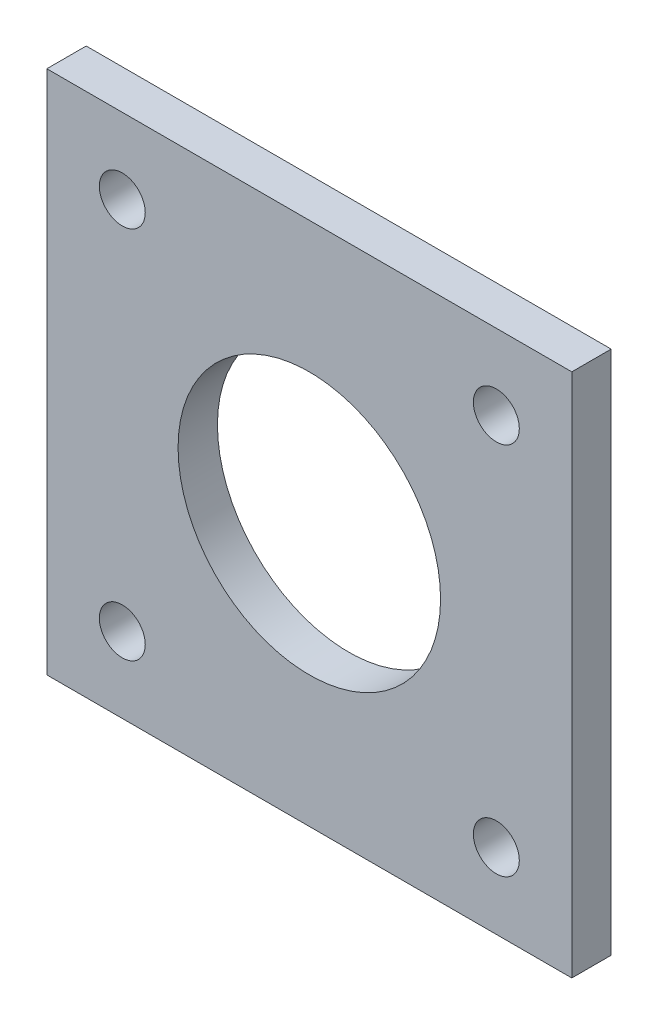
ISO-10303-21;
HEADER;
FILE_DESCRIPTION(('STEP AP214'),'2;1');
FILE_NAME('part.step','',(''),(''),'','','');
FILE_SCHEMA(('AUTOMOTIVE_DESIGN { 1 0 10303 214 1 1 1 1 }'));
ENDSEC;
DATA;
#1=APPLICATION_CONTEXT('core data for automotive mechanical design processes');
#2=APPLICATION_PROTOCOL_DEFINITION('international standard','automotive_design',2000,#1);
#3=PRODUCT_CONTEXT('',#1,'mechanical');
#4=PRODUCT('Part','Part','',(#3));
#5=PRODUCT_RELATED_PRODUCT_CATEGORY('part','',(#4));
#6=PRODUCT_DEFINITION_FORMATION('','',#4);
#7=PRODUCT_DEFINITION_CONTEXT('part definition',#1,'design');
#8=PRODUCT_DEFINITION('design','',#6,#7);
#9=PRODUCT_DEFINITION_SHAPE('','',#8);
#10=(LENGTH_UNIT() NAMED_UNIT(*) SI_UNIT(.MILLI.,.METRE.));
#11=(NAMED_UNIT(*) PLANE_ANGLE_UNIT() SI_UNIT($,.RADIAN.));
#12=(NAMED_UNIT(*) SI_UNIT($,.STERADIAN.) SOLID_ANGLE_UNIT());
#13=UNCERTAINTY_MEASURE_WITH_UNIT(LENGTH_MEASURE(1.E-05),#10,'distance_accuracy_value','');
#14=(GEOMETRIC_REPRESENTATION_CONTEXT(3) GLOBAL_UNCERTAINTY_ASSIGNED_CONTEXT((#13)) GLOBAL_UNIT_ASSIGNED_CONTEXT((#10,
#11,#12)) REPRESENTATION_CONTEXT('',''));
#15=CARTESIAN_POINT('',(0.,0.,0.));
#16=DIRECTION('',(0.,0.,1.));
#17=DIRECTION('',(1.,0.,0.));
#18=AXIS2_PLACEMENT_3D('',#15,#16,#17);
#19=CARTESIAN_POINT('',(20.,20.,3.));
#20=DIRECTION('',(-1.,0.,0.));
#21=DIRECTION('',(0.,-1.,0.));
#22=AXIS2_PLACEMENT_3D('',#19,#20,#21);
#23=PLANE('',#22);
#24=DIRECTION('',(0.,1.,0.));
#25=VECTOR('',#24,1.);
#26=CARTESIAN_POINT('',(20.,20.,0.));
#27=LINE('',#26,#25);
#28=CARTESIAN_POINT('',(20.,-20.,0.));
#29=VERTEX_POINT('',#28);
#30=CARTESIAN_POINT('',(20.,20.,0.));
#31=VERTEX_POINT('',#30);
#32=EDGE_CURVE('E98',#29,#31,#27,.T.);
#33=ORIENTED_EDGE('',*,*,#32,.T.);
#34=DIRECTION('',(0.,0.,-1.));
#35=VECTOR('',#34,1.);
#36=CARTESIAN_POINT('',(20.,20.,3.));
#37=LINE('',#36,#35);
#38=CARTESIAN_POINT('',(20.,20.,3.));
#39=VERTEX_POINT('',#38);
#40=EDGE_CURVE('E11',#39,#31,#37,.T.);
#41=ORIENTED_EDGE('',*,*,#40,.F.);
#42=DIRECTION('',(0.,1.,0.));
#43=VECTOR('',#42,1.);
#44=CARTESIAN_POINT('',(20.,20.,3.));
#45=LINE('',#44,#43);
#46=CARTESIAN_POINT('',(20.,-20.,3.));
#47=VERTEX_POINT('',#46);
#48=EDGE_CURVE('E86',#47,#39,#45,.T.);
#49=ORIENTED_EDGE('',*,*,#48,.F.);
#50=DIRECTION('',(0.,0.,-1.));
#51=VECTOR('',#50,1.);
#52=CARTESIAN_POINT('',(20.,-20.,3.));
#53=LINE('',#52,#51);
#54=EDGE_CURVE('E94',#47,#29,#53,.T.);
#55=ORIENTED_EDGE('',*,*,#54,.T.);
#56=EDGE_LOOP('',(#33,#41,#49,#55));
#57=FACE_BOUND('',#56,.T.);
#58=ADVANCED_FACE('F35',(#57),#23,.F.);
#59=CARTESIAN_POINT('',(-20.,20.,3.));
#60=DIRECTION('',(0.,-1.,0.));
#61=DIRECTION('',(0.,0.,-1.));
#62=AXIS2_PLACEMENT_3D('',#59,#60,#61);
#63=PLANE('',#62);
#64=DIRECTION('',(-1.,0.,0.));
#65=VECTOR('',#64,1.);
#66=CARTESIAN_POINT('',(-20.,20.,0.));
#67=LINE('',#66,#65);
#68=CARTESIAN_POINT('',(-20.,20.,0.));
#69=VERTEX_POINT('',#68);
#70=EDGE_CURVE('E90',#31,#69,#67,.T.);
#71=ORIENTED_EDGE('',*,*,#70,.T.);
#72=DIRECTION('',(0.,0.,-1.));
#73=VECTOR('',#72,1.);
#74=CARTESIAN_POINT('',(-20.,20.,3.));
#75=LINE('',#74,#73);
#76=CARTESIAN_POINT('',(-20.,20.,3.));
#77=VERTEX_POINT('',#76);
#78=EDGE_CURVE('E43',#77,#69,#75,.T.);
#79=ORIENTED_EDGE('',*,*,#78,.F.);
#80=DIRECTION('',(-1.,0.,0.));
#81=VECTOR('',#80,1.);
#82=CARTESIAN_POINT('',(-20.,20.,3.));
#83=LINE('',#82,#81);
#84=EDGE_CURVE('E81',#39,#77,#83,.T.);
#85=ORIENTED_EDGE('',*,*,#84,.F.);
#86=ORIENTED_EDGE('',*,*,#40,.T.);
#87=EDGE_LOOP('',(#71,#79,#85,#86));
#88=FACE_BOUND('',#87,.T.);
#89=ADVANCED_FACE('F89',(#88),#63,.F.);
#90=CARTESIAN_POINT('',(-20.,20.,3.));
#91=DIRECTION('',(1.,0.,0.));
#92=DIRECTION('',(0.,0.,-1.));
#93=AXIS2_PLACEMENT_3D('',#90,#91,#92);
#94=PLANE('',#93);
#95=DIRECTION('',(0.,-1.,0.));
#96=VECTOR('',#95,1.);
#97=CARTESIAN_POINT('',(-20.,20.,0.));
#98=LINE('',#97,#96);
#99=CARTESIAN_POINT('',(-20.,-20.,0.));
#100=VERTEX_POINT('',#99);
#101=EDGE_CURVE('E68',#69,#100,#98,.T.);
#102=ORIENTED_EDGE('',*,*,#101,.T.);
#103=DIRECTION('',(0.,0.,-1.));
#104=VECTOR('',#103,1.);
#105=CARTESIAN_POINT('',(-20.,-20.,3.));
#106=LINE('',#105,#104);
#107=CARTESIAN_POINT('',(-20.,-20.,3.));
#108=VERTEX_POINT('',#107);
#109=EDGE_CURVE('E91',#108,#100,#106,.T.);
#110=ORIENTED_EDGE('',*,*,#109,.F.);
#111=DIRECTION('',(0.,-1.,0.));
#112=VECTOR('',#111,1.);
#113=CARTESIAN_POINT('',(-20.,20.,3.));
#114=LINE('',#113,#112);
#115=EDGE_CURVE('E84',#77,#108,#114,.T.);
#116=ORIENTED_EDGE('',*,*,#115,.F.);
#117=ORIENTED_EDGE('',*,*,#78,.T.);
#118=EDGE_LOOP('',(#102,#110,#116,#117));
#119=FACE_BOUND('',#118,.T.);
#120=ADVANCED_FACE('F92',(#119),#94,.F.);
#121=CARTESIAN_POINT('',(-20.,-20.,3.));
#122=DIRECTION('',(0.,1.,0.));
#123=DIRECTION('',(0.,0.,1.));
#124=AXIS2_PLACEMENT_3D('',#121,#122,#123);
#125=PLANE('',#124);
#126=DIRECTION('',(1.,0.,0.));
#127=VECTOR('',#126,1.);
#128=CARTESIAN_POINT('',(-20.,-20.,0.));
#129=LINE('',#128,#127);
#130=EDGE_CURVE('E74',#100,#29,#129,.T.);
#131=ORIENTED_EDGE('',*,*,#130,.T.);
#132=ORIENTED_EDGE('',*,*,#54,.F.);
#133=DIRECTION('',(1.,0.,0.));
#134=VECTOR('',#133,1.);
#135=CARTESIAN_POINT('',(-20.,-20.,3.));
#136=LINE('',#135,#134);
#137=EDGE_CURVE('E51',#108,#47,#136,.T.);
#138=ORIENTED_EDGE('',*,*,#137,.F.);
#139=ORIENTED_EDGE('',*,*,#109,.T.);
#140=EDGE_LOOP('',(#131,#132,#138,#139));
#141=FACE_BOUND('',#140,.T.);
#142=ADVANCED_FACE('F106',(#141),#125,.F.);
#143=CARTESIAN_POINT('',(0.,0.,3.));
#144=DIRECTION('',(0.,0.,1.));
#145=DIRECTION('',(1.,0.,0.));
#146=AXIS2_PLACEMENT_3D('',#143,#144,#145);
#147=PLANE('',#146);
#148=CARTESIAN_POINT('',(0.,0.,3.));
#149=DIRECTION('',(0.,0.,1.));
#150=DIRECTION('',(1.,0.,0.));
#151=AXIS2_PLACEMENT_3D('',#148,#149,#150);
#152=CIRCLE('',#151,10.);
#153=CARTESIAN_POINT('',(10.,0.,3.));
#154=VERTEX_POINT('',#153);
#155=EDGE_CURVE('E136',#154,#154,#152,.T.);
#156=ORIENTED_EDGE('',*,*,#155,.F.);
#157=EDGE_LOOP('',(#156));
#158=FACE_BOUND('',#157,.T.);
#159=CARTESIAN_POINT('',(-14.25,14.25,3.));
#160=DIRECTION('',(0.,0.,1.));
#161=DIRECTION('',(1.,0.,0.));
#162=AXIS2_PLACEMENT_3D('',#159,#160,#161);
#163=CIRCLE('',#162,1.74999999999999);
#164=CARTESIAN_POINT('',(-12.5,14.25,3.));
#165=VERTEX_POINT('',#164);
#166=EDGE_CURVE('E132',#165,#165,#163,.T.);
#167=ORIENTED_EDGE('',*,*,#166,.F.);
#168=EDGE_LOOP('',(#167));
#169=FACE_BOUND('',#168,.T.);
#170=CARTESIAN_POINT('',(14.25,14.25,3.));
#171=DIRECTION('',(0.,0.,1.));
#172=DIRECTION('',(1.,0.,0.));
#173=AXIS2_PLACEMENT_3D('',#170,#171,#172);
#174=CIRCLE('',#173,1.74999999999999);
#175=CARTESIAN_POINT('',(16.,14.25,3.));
#176=VERTEX_POINT('',#175);
#177=EDGE_CURVE('E126',#176,#176,#174,.T.);
#178=ORIENTED_EDGE('',*,*,#177,.F.);
#179=EDGE_LOOP('',(#178));
#180=FACE_BOUND('',#179,.T.);
#181=CARTESIAN_POINT('',(14.25,-14.25,3.));
#182=DIRECTION('',(0.,0.,1.));
#183=DIRECTION('',(1.,0.,0.));
#184=AXIS2_PLACEMENT_3D('',#181,#182,#183);
#185=CIRCLE('',#184,1.74999999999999);
#186=CARTESIAN_POINT('',(16.,-14.25,3.));
#187=VERTEX_POINT('',#186);
#188=EDGE_CURVE('E120',#187,#187,#185,.T.);
#189=ORIENTED_EDGE('',*,*,#188,.F.);
#190=EDGE_LOOP('',(#189));
#191=FACE_BOUND('',#190,.T.);
#192=CARTESIAN_POINT('',(-14.25,-14.25,3.));
#193=DIRECTION('',(0.,0.,1.));
#194=DIRECTION('',(1.,0.,0.));
#195=AXIS2_PLACEMENT_3D('',#192,#193,#194);
#196=CIRCLE('',#195,1.74999999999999);
#197=CARTESIAN_POINT('',(-12.5,-14.25,3.));
#198=VERTEX_POINT('',#197);
#199=EDGE_CURVE('E114',#198,#198,#196,.T.);
#200=ORIENTED_EDGE('',*,*,#199,.F.);
#201=EDGE_LOOP('',(#200));
#202=FACE_BOUND('',#201,.T.);
#203=ORIENTED_EDGE('',*,*,#48,.T.);
#204=ORIENTED_EDGE('',*,*,#84,.T.);
#205=ORIENTED_EDGE('',*,*,#115,.T.);
#206=ORIENTED_EDGE('',*,*,#137,.T.);
#207=EDGE_LOOP('',(#203,#204,#205,#206));
#208=FACE_BOUND('',#207,.T.);
#209=ADVANCED_FACE('F82',(#158,#169,#180,#191,#202,#208),#147,.T.);
#210=CARTESIAN_POINT('',(0.,0.,0.));
#211=DIRECTION('',(0.,0.,1.));
#212=DIRECTION('',(1.,0.,0.));
#213=AXIS2_PLACEMENT_3D('',#210,#211,#212);
#214=PLANE('',#213);
#215=CARTESIAN_POINT('',(0.,0.,0.));
#216=DIRECTION('',(0.,0.,1.));
#217=DIRECTION('',(1.,0.,0.));
#218=AXIS2_PLACEMENT_3D('',#215,#216,#217);
#219=CIRCLE('',#218,10.);
#220=CARTESIAN_POINT('',(10.,0.,0.));
#221=VERTEX_POINT('',#220);
#222=EDGE_CURVE('E135',#221,#221,#219,.T.);
#223=ORIENTED_EDGE('',*,*,#222,.T.);
#224=EDGE_LOOP('',(#223));
#225=FACE_BOUND('',#224,.T.);
#226=CARTESIAN_POINT('',(-14.25,14.25,0.));
#227=DIRECTION('',(0.,0.,1.));
#228=DIRECTION('',(1.,0.,0.));
#229=AXIS2_PLACEMENT_3D('',#226,#227,#228);
#230=CIRCLE('',#229,1.74999999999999);
#231=CARTESIAN_POINT('',(-12.5,14.25,0.));
#232=VERTEX_POINT('',#231);
#233=EDGE_CURVE('E129',#232,#232,#230,.T.);
#234=ORIENTED_EDGE('',*,*,#233,.T.);
#235=EDGE_LOOP('',(#234));
#236=FACE_BOUND('',#235,.T.);
#237=CARTESIAN_POINT('',(14.25,14.25,0.));
#238=DIRECTION('',(0.,0.,1.));
#239=DIRECTION('',(1.,0.,0.));
#240=AXIS2_PLACEMENT_3D('',#237,#238,#239);
#241=CIRCLE('',#240,1.74999999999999);
#242=CARTESIAN_POINT('',(16.,14.25,0.));
#243=VERTEX_POINT('',#242);
#244=EDGE_CURVE('E123',#243,#243,#241,.T.);
#245=ORIENTED_EDGE('',*,*,#244,.T.);
#246=EDGE_LOOP('',(#245));
#247=FACE_BOUND('',#246,.T.);
#248=CARTESIAN_POINT('',(14.25,-14.25,0.));
#249=DIRECTION('',(0.,0.,1.));
#250=DIRECTION('',(1.,0.,0.));
#251=AXIS2_PLACEMENT_3D('',#248,#249,#250);
#252=CIRCLE('',#251,1.74999999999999);
#253=CARTESIAN_POINT('',(16.,-14.25,0.));
#254=VERTEX_POINT('',#253);
#255=EDGE_CURVE('E117',#254,#254,#252,.T.);
#256=ORIENTED_EDGE('',*,*,#255,.T.);
#257=EDGE_LOOP('',(#256));
#258=FACE_BOUND('',#257,.T.);
#259=CARTESIAN_POINT('',(-14.25,-14.25,0.));
#260=DIRECTION('',(0.,0.,1.));
#261=DIRECTION('',(1.,0.,0.));
#262=AXIS2_PLACEMENT_3D('',#259,#260,#261);
#263=CIRCLE('',#262,1.74999999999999);
#264=CARTESIAN_POINT('',(-12.5,-14.25,0.));
#265=VERTEX_POINT('',#264);
#266=EDGE_CURVE('E101',#265,#265,#263,.T.);
#267=ORIENTED_EDGE('',*,*,#266,.T.);
#268=EDGE_LOOP('',(#267));
#269=FACE_BOUND('',#268,.T.);
#270=ORIENTED_EDGE('',*,*,#32,.F.);
#271=ORIENTED_EDGE('',*,*,#130,.F.);
#272=ORIENTED_EDGE('',*,*,#101,.F.);
#273=ORIENTED_EDGE('',*,*,#70,.F.);
#274=EDGE_LOOP('',(#270,#271,#272,#273));
#275=FACE_BOUND('',#274,.T.);
#276=ADVANCED_FACE('F109',(#225,#236,#247,#258,#269,#275),#214,.F.);
#277=CARTESIAN_POINT('',(-14.25,-14.25,3.));
#278=DIRECTION('',(0.,0.,1.));
#279=DIRECTION('',(1.,0.,0.));
#280=AXIS2_PLACEMENT_3D('',#277,#278,#279);
#281=CYLINDRICAL_SURFACE('',#280,1.74999999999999);
#282=ORIENTED_EDGE('',*,*,#199,.T.);
#283=EDGE_LOOP('',(#282));
#284=FACE_BOUND('',#283,.T.);
#285=ORIENTED_EDGE('',*,*,#266,.F.);
#286=EDGE_LOOP('',(#285));
#287=FACE_BOUND('',#286,.T.);
#288=ADVANCED_FACE('F162',(#284,#287),#281,.F.);
#289=CARTESIAN_POINT('',(14.25,-14.25,3.));
#290=DIRECTION('',(0.,0.,1.));
#291=DIRECTION('',(1.,0.,0.));
#292=AXIS2_PLACEMENT_3D('',#289,#290,#291);
#293=CYLINDRICAL_SURFACE('',#292,1.74999999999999);
#294=ORIENTED_EDGE('',*,*,#188,.T.);
#295=EDGE_LOOP('',(#294));
#296=FACE_BOUND('',#295,.T.);
#297=ORIENTED_EDGE('',*,*,#255,.F.);
#298=EDGE_LOOP('',(#297));
#299=FACE_BOUND('',#298,.T.);
#300=ADVANCED_FACE('F165',(#296,#299),#293,.F.);
#301=CARTESIAN_POINT('',(14.25,14.25,3.));
#302=DIRECTION('',(0.,0.,1.));
#303=DIRECTION('',(1.,0.,0.));
#304=AXIS2_PLACEMENT_3D('',#301,#302,#303);
#305=CYLINDRICAL_SURFACE('',#304,1.74999999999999);
#306=ORIENTED_EDGE('',*,*,#177,.T.);
#307=EDGE_LOOP('',(#306));
#308=FACE_BOUND('',#307,.T.);
#309=ORIENTED_EDGE('',*,*,#244,.F.);
#310=EDGE_LOOP('',(#309));
#311=FACE_BOUND('',#310,.T.);
#312=ADVANCED_FACE('F209',(#308,#311),#305,.F.);
#313=CARTESIAN_POINT('',(-14.25,14.25,3.));
#314=DIRECTION('',(0.,0.,1.));
#315=DIRECTION('',(1.,0.,0.));
#316=AXIS2_PLACEMENT_3D('',#313,#314,#315);
#317=CYLINDRICAL_SURFACE('',#316,1.74999999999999);
#318=ORIENTED_EDGE('',*,*,#166,.T.);
#319=EDGE_LOOP('',(#318));
#320=FACE_BOUND('',#319,.T.);
#321=ORIENTED_EDGE('',*,*,#233,.F.);
#322=EDGE_LOOP('',(#321));
#323=FACE_BOUND('',#322,.T.);
#324=ADVANCED_FACE('F147',(#320,#323),#317,.F.);
#325=CARTESIAN_POINT('',(0.,0.,0.));
#326=DIRECTION('',(0.,0.,1.));
#327=DIRECTION('',(1.,0.,0.));
#328=AXIS2_PLACEMENT_3D('',#325,#326,#327);
#329=CYLINDRICAL_SURFACE('',#328,10.);
#330=ORIENTED_EDGE('',*,*,#222,.F.);
#331=EDGE_LOOP('',(#330));
#332=FACE_BOUND('',#331,.T.);
#333=ORIENTED_EDGE('',*,*,#155,.T.);
#334=EDGE_LOOP('',(#333));
#335=FACE_BOUND('',#334,.T.);
#336=ADVANCED_FACE('F144',(#332,#335),#329,.F.);
#337=CLOSED_SHELL('',(#58,#89,#120,#142,#209,#276,#288,#300,#312,#324,#336));
#338=MANIFOLD_SOLID_BREP('B2',#337);
#339=ADVANCED_BREP_SHAPE_REPRESENTATION('',(#18,#338),#14);
#340=SHAPE_DEFINITION_REPRESENTATION(#9,#339);
ENDSEC;
END-ISO-10303-21;
